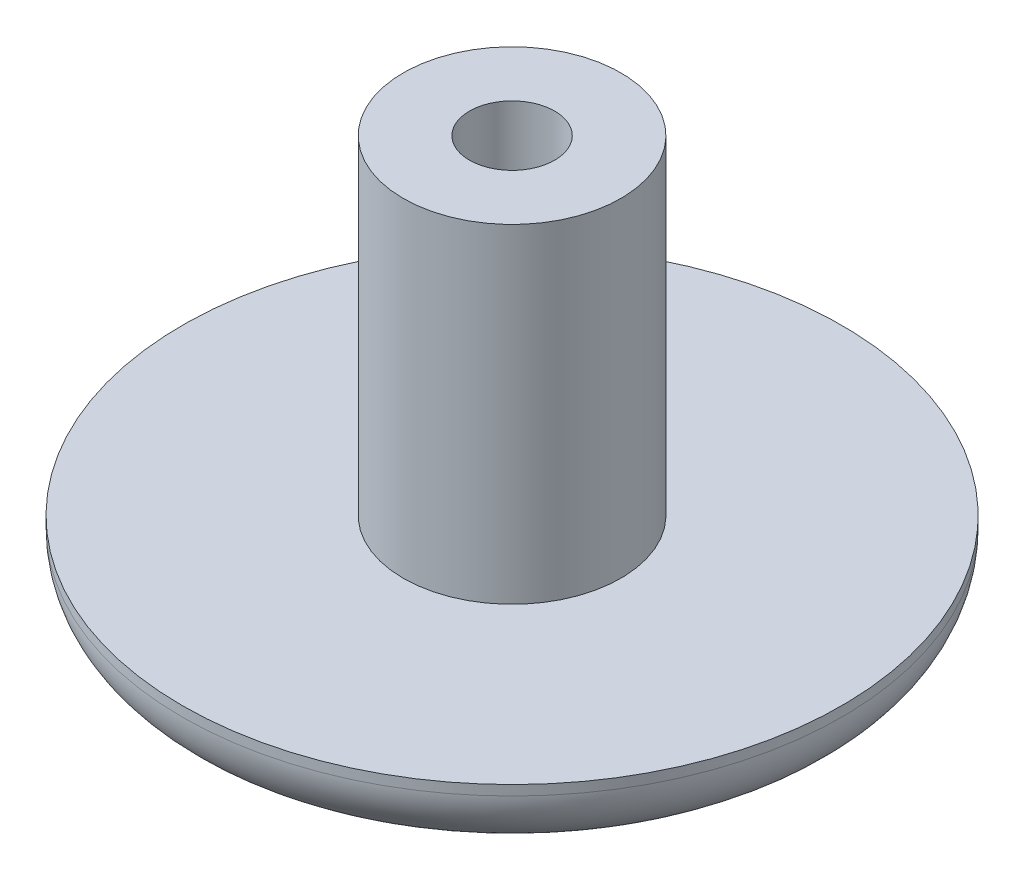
ISO-10303-21;
HEADER;
FILE_DESCRIPTION(('STEP AP214'),'2;1');
FILE_NAME('part.step','',(''),(''),'','','');
FILE_SCHEMA(('AUTOMOTIVE_DESIGN { 1 0 10303 214 1 1 1 1 }'));
ENDSEC;
DATA;
#1=APPLICATION_CONTEXT('core data for automotive mechanical design processes');
#2=APPLICATION_PROTOCOL_DEFINITION('international standard','automotive_design',2000,#1);
#3=PRODUCT_CONTEXT('',#1,'mechanical');
#4=PRODUCT('Part','Part','',(#3));
#5=PRODUCT_RELATED_PRODUCT_CATEGORY('part','',(#4));
#6=PRODUCT_DEFINITION_FORMATION('','',#4);
#7=PRODUCT_DEFINITION_CONTEXT('part definition',#1,'design');
#8=PRODUCT_DEFINITION('design','',#6,#7);
#9=PRODUCT_DEFINITION_SHAPE('','',#8);
#10=(LENGTH_UNIT() NAMED_UNIT(*) SI_UNIT(.MILLI.,.METRE.));
#11=(NAMED_UNIT(*) PLANE_ANGLE_UNIT() SI_UNIT($,.RADIAN.));
#12=(NAMED_UNIT(*) SI_UNIT($,.STERADIAN.) SOLID_ANGLE_UNIT());
#13=UNCERTAINTY_MEASURE_WITH_UNIT(LENGTH_MEASURE(1.E-05),#10,'distance_accuracy_value','');
#14=(GEOMETRIC_REPRESENTATION_CONTEXT(3) GLOBAL_UNCERTAINTY_ASSIGNED_CONTEXT((#13)) GLOBAL_UNIT_ASSIGNED_CONTEXT((#10,
#11,#12)) REPRESENTATION_CONTEXT('',''));
#15=CARTESIAN_POINT('',(0.,0.,0.));
#16=DIRECTION('',(0.,0.,1.));
#17=DIRECTION('',(1.,0.,0.));
#18=AXIS2_PLACEMENT_3D('',#15,#16,#17);
#19=CARTESIAN_POINT('',(0.,0.,0.));
#20=DIRECTION('',(0.,1.,0.));
#21=DIRECTION('',(0.,0.,1.));
#22=AXIS2_PLACEMENT_3D('',#19,#20,#21);
#23=PLANE('',#22);
#24=CARTESIAN_POINT('',(0.,0.,0.));
#25=DIRECTION('',(0.,1.,0.));
#26=DIRECTION('',(0.,0.,1.));
#27=AXIS2_PLACEMENT_3D('',#24,#25,#26);
#28=CIRCLE('',#27,4.29999999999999);
#29=CARTESIAN_POINT('',(0.,0.,4.29999999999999));
#30=VERTEX_POINT('',#29);
#31=EDGE_CURVE('E10',#30,#30,#28,.T.);
#32=ORIENTED_EDGE('',*,*,#31,.F.);
#33=EDGE_LOOP('',(#32));
#34=FACE_BOUND('',#33,.T.);
#35=ADVANCED_FACE('F25',(#34),#23,.F.);
#36=CARTESIAN_POINT('',(0.,1.,0.));
#37=DIRECTION('',(0.,1.,0.));
#38=DIRECTION('',(0.,0.,1.));
#39=AXIS2_PLACEMENT_3D('',#36,#37,#38);
#40=TOROIDAL_SURFACE('',#39,4.3,1.);
#41=CARTESIAN_POINT('',(0.,1.00000000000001,0.));
#42=DIRECTION('',(0.,1.,0.));
#43=DIRECTION('',(0.,0.,1.));
#44=AXIS2_PLACEMENT_3D('',#41,#42,#43);
#45=CIRCLE('',#44,5.3);
#46=CARTESIAN_POINT('',(0.,1.00000000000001,5.3));
#47=VERTEX_POINT('',#46);
#48=EDGE_CURVE('E31',#47,#47,#45,.T.);
#49=ORIENTED_EDGE('',*,*,#48,.F.);
#50=EDGE_LOOP('',(#49));
#51=FACE_BOUND('',#50,.T.);
#52=ORIENTED_EDGE('',*,*,#31,.T.);
#53=EDGE_LOOP('',(#52));
#54=FACE_BOUND('',#53,.T.);
#55=ADVANCED_FACE('F76',(#51,#54),#40,.T.);
#56=CARTESIAN_POINT('',(0.,6.45,0.));
#57=DIRECTION('',(0.,1.,0.));
#58=DIRECTION('',(0.,0.,1.));
#59=AXIS2_PLACEMENT_3D('',#56,#57,#58);
#60=CYLINDRICAL_SURFACE('',#59,5.3);
#61=CARTESIAN_POINT('',(0.,1.16,0.));
#62=DIRECTION('',(0.,1.,0.));
#63=DIRECTION('',(0.,0.,1.));
#64=AXIS2_PLACEMENT_3D('',#61,#62,#63);
#65=CIRCLE('',#64,5.3);
#66=CARTESIAN_POINT('',(0.,1.16,5.3));
#67=VERTEX_POINT('',#66);
#68=EDGE_CURVE('E35',#67,#67,#65,.T.);
#69=ORIENTED_EDGE('',*,*,#68,.F.);
#70=EDGE_LOOP('',(#69));
#71=FACE_BOUND('',#70,.T.);
#72=ORIENTED_EDGE('',*,*,#48,.T.);
#73=EDGE_LOOP('',(#72));
#74=FACE_BOUND('',#73,.T.);
#75=ADVANCED_FACE('F71',(#71,#74),#60,.T.);
#76=CARTESIAN_POINT('',(5.3,1.16,0.));
#77=DIRECTION('',(0.,-1.,0.));
#78=DIRECTION('',(0.,0.,-1.));
#79=AXIS2_PLACEMENT_3D('',#76,#77,#78);
#80=PLANE('',#79);
#81=CARTESIAN_POINT('',(0.,1.16,0.));
#82=DIRECTION('',(0.,1.,0.));
#83=DIRECTION('',(0.,0.,1.));
#84=AXIS2_PLACEMENT_3D('',#81,#82,#83);
#85=CIRCLE('',#84,1.75);
#86=CARTESIAN_POINT('',(0.,1.16,1.75));
#87=VERTEX_POINT('',#86);
#88=EDGE_CURVE('E39',#87,#87,#85,.T.);
#89=ORIENTED_EDGE('',*,*,#88,.F.);
#90=EDGE_LOOP('',(#89));
#91=FACE_BOUND('',#90,.T.);
#92=ORIENTED_EDGE('',*,*,#68,.T.);
#93=EDGE_LOOP('',(#92));
#94=FACE_BOUND('',#93,.T.);
#95=ADVANCED_FACE('F65',(#91,#94),#80,.F.);
#96=CARTESIAN_POINT('',(0.,6.45,0.));
#97=DIRECTION('',(0.,1.,0.));
#98=DIRECTION('',(0.,0.,1.));
#99=AXIS2_PLACEMENT_3D('',#96,#97,#98);
#100=CYLINDRICAL_SURFACE('',#99,1.75);
#101=CARTESIAN_POINT('',(0.,6.45,0.));
#102=DIRECTION('',(0.,1.,0.));
#103=DIRECTION('',(0.,0.,1.));
#104=AXIS2_PLACEMENT_3D('',#101,#102,#103);
#105=CIRCLE('',#104,1.75);
#106=CARTESIAN_POINT('',(0.,6.45,1.75));
#107=VERTEX_POINT('',#106);
#108=EDGE_CURVE('E44',#107,#107,#105,.T.);
#109=ORIENTED_EDGE('',*,*,#108,.F.);
#110=EDGE_LOOP('',(#109));
#111=FACE_BOUND('',#110,.T.);
#112=ORIENTED_EDGE('',*,*,#88,.T.);
#113=EDGE_LOOP('',(#112));
#114=FACE_BOUND('',#113,.T.);
#115=ADVANCED_FACE('F59',(#111,#114),#100,.T.);
#116=CARTESIAN_POINT('',(1.75,6.45,0.));
#117=DIRECTION('',(0.,-1.,0.));
#118=DIRECTION('',(0.,0.,-1.));
#119=AXIS2_PLACEMENT_3D('',#116,#117,#118);
#120=PLANE('',#119);
#121=CARTESIAN_POINT('',(0.,6.45,0.));
#122=DIRECTION('',(0.,1.,0.));
#123=DIRECTION('',(0.,0.,1.));
#124=AXIS2_PLACEMENT_3D('',#121,#122,#123);
#125=CIRCLE('',#124,0.685);
#126=CARTESIAN_POINT('',(0.,6.45,0.685));
#127=VERTEX_POINT('',#126);
#128=EDGE_CURVE('E50',#127,#127,#125,.T.);
#129=ORIENTED_EDGE('',*,*,#128,.F.);
#130=EDGE_LOOP('',(#129));
#131=FACE_BOUND('',#130,.T.);
#132=ORIENTED_EDGE('',*,*,#108,.T.);
#133=EDGE_LOOP('',(#132));
#134=FACE_BOUND('',#133,.T.);
#135=ADVANCED_FACE('F56',(#131,#134),#120,.F.);
#136=CARTESIAN_POINT('',(0.,1.45,0.));
#137=DIRECTION('',(0.,1.,0.));
#138=DIRECTION('',(0.,0.,1.));
#139=AXIS2_PLACEMENT_3D('',#136,#137,#138);
#140=CYLINDRICAL_SURFACE('',#139,0.685);
#141=CARTESIAN_POINT('',(0.,1.45,0.));
#142=DIRECTION('',(0.,1.,0.));
#143=DIRECTION('',(0.,0.,1.));
#144=AXIS2_PLACEMENT_3D('',#141,#142,#143);
#145=CIRCLE('',#144,0.685);
#146=CARTESIAN_POINT('',(0.,1.45,0.685));
#147=VERTEX_POINT('',#146);
#148=EDGE_CURVE('E47',#147,#147,#145,.T.);
#149=ORIENTED_EDGE('',*,*,#148,.F.);
#150=EDGE_LOOP('',(#149));
#151=FACE_BOUND('',#150,.T.);
#152=ORIENTED_EDGE('',*,*,#128,.T.);
#153=EDGE_LOOP('',(#152));
#154=FACE_BOUND('',#153,.T.);
#155=ADVANCED_FACE('F54',(#151,#154),#140,.F.);
#156=CARTESIAN_POINT('',(0.,1.45,0.));
#157=DIRECTION('',(0.,1.,0.));
#158=DIRECTION('',(0.,0.,1.));
#159=AXIS2_PLACEMENT_3D('',#156,#157,#158);
#160=PLANE('',#159);
#161=ORIENTED_EDGE('',*,*,#148,.T.);
#162=EDGE_LOOP('',(#161));
#163=FACE_BOUND('',#162,.T.);
#164=ADVANCED_FACE('F111',(#163),#160,.T.);
#165=CLOSED_SHELL('',(#35,#55,#75,#95,#115,#135,#155,#164));
#166=MANIFOLD_SOLID_BREP('B2',#165);
#167=ADVANCED_BREP_SHAPE_REPRESENTATION('',(#18,#166),#14);
#168=SHAPE_DEFINITION_REPRESENTATION(#9,#167);
ENDSEC;
END-ISO-10303-21;
